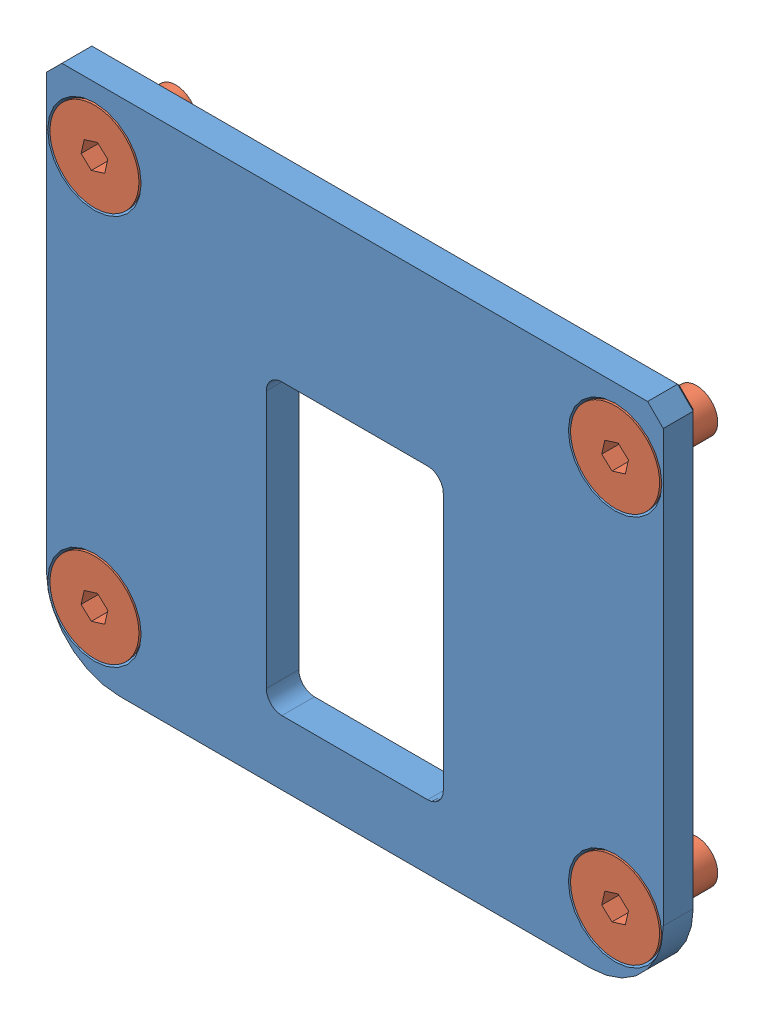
SolidWorks assembly CV-PLT.sldasm, configuration Default (file format 12000). Lengths in mm.
Overall size (63.06 50.67 7.94).
5 component instances, 2 part files, 4 mates.
Components (placement in the parent):
- CV-PLT-1: CV-PLT.sldprt [Default] at origin size (60.2 50.67 3.17)
- FHCS8-32L.31-1: FHCS8-32L.31.sldprt [FHCS8-32L.37] at (-25.4 -6.2865 0) x (-0.679416 -0.733753 0) z (0 0 -1) size (8.68 8.68 7.94)
- FHCS8-32L.31-2: FHCS8-32L.31.sldprt [FHCS8-32L.37] at (25.4 -6.2865 0) x (-0.679416 -0.733753 0) z (0 0 -1) size (8.68 8.68 7.94)
- FHCS8-32L.31-3: FHCS8-32L.31.sldprt [FHCS8-32L.37] at (-25.4 -44.3865 0) x (-0.679416 -0.733753 0) z (0 0 -1) size (8.68 8.68 7.94)
- FHCS8-32L.31-4: FHCS8-32L.31.sldprt [FHCS8-32L.37] at (25.4 -44.3865 0) x (-0.679416 -0.733753 0) z (0 0 -1) size (8.68 8.68 7.94)
Mates (geometry in assembly coordinates):
- Coincident1: coincident aligned: cone of CV-PLT-1 through (-25.4 -6.2865 0) axis (0 0 -1); cone of FHCS8-32L.31-1 through (-25.4 -6.2865 -2.8489) axis (0 0 -1)
- Coincident2: coincident aligned: cone of CV-PLT-1 through (-25.4 -44.3865 0) axis (0 0 -1); cone of FHCS8-32L.31-3 through (-25.4 -44.3865 -2.8489) axis (0 0 -1)
- Coincident3: coincident aligned: cone of CV-PLT-1 through (25.4 -44.3865 0) axis (0 0 -1); cone of FHCS8-32L.31-4 through (25.4 -44.3865 -2.8489) axis (0 0 -1)
- Coincident4: coincident aligned: cone of CV-PLT-1 through (25.4 -6.2865 0) axis (0 0 -1); cone of FHCS8-32L.31-2 through (25.4 -6.2865 -2.8489) axis (0 0 -1)
